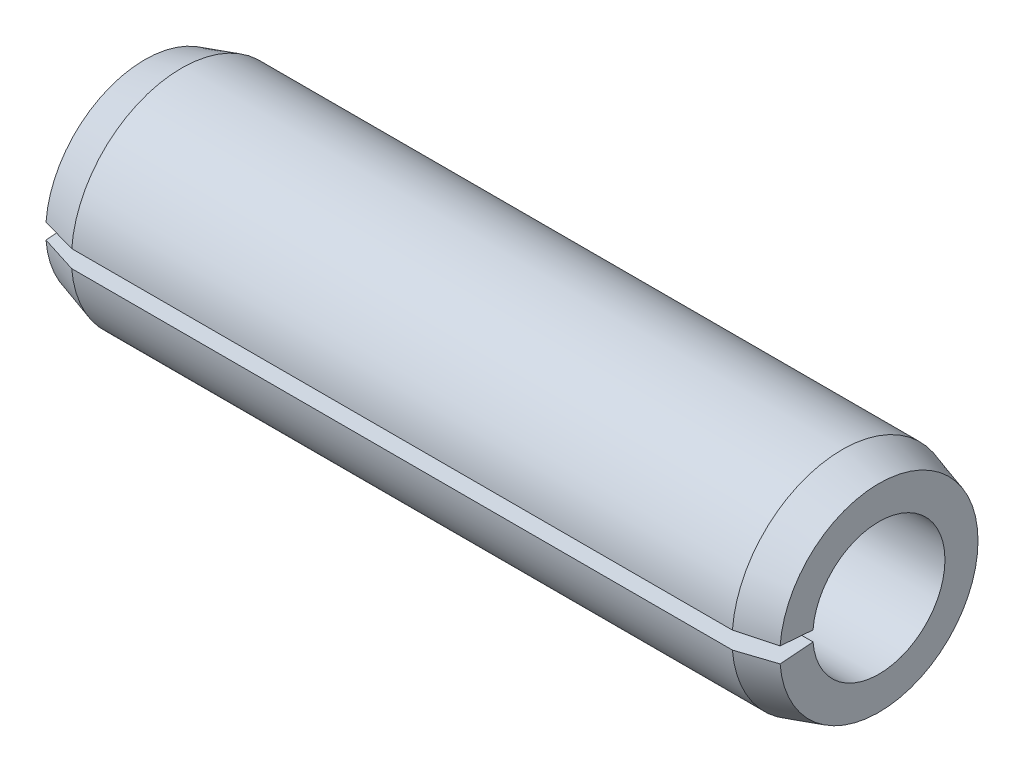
from build123d import *

# Parameters (mm, degrees)
GAP_DEPTH = 11.22252415


with BuildPart() as part:
    # Sketch1 → Base-Revolve (revolve)
    with BuildSketch(Plane.XY, mode=Mode.PRIVATE) as base_revolve_sk:
        Polygon((0, 0.9), (10, 0.9), (10, 1.35), (9.5, 1.5), (0.5, 1.5), (0, 1.35), align=None)
    revolve(base_revolve_sk.sketch.rotate(Axis((-9.525, 0, 0), (1, 0, 0)), 90), axis=Axis((-9.525, 0, 0), (1, 0, 0)))

    # Sketch2 → Gap (cut, through all)
    with BuildSketch(Plane(origin=(0, 0, 0), x_dir=(0, -1, 0), z_dir=(-1, 0, 0))):
        with BuildLine():
            Line((0, 0), (0.120042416, 1.525283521))
            ThreePointArc((0.120042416, 1.525283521), (0, 1.53), (-0.120042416, 1.525283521))
            Line((-0.120042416, 1.525283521), (0, 0))
        make_face()
    extrude(amount=-GAP_DEPTH, mode=Mode.SUBTRACT)


solid = part.part
